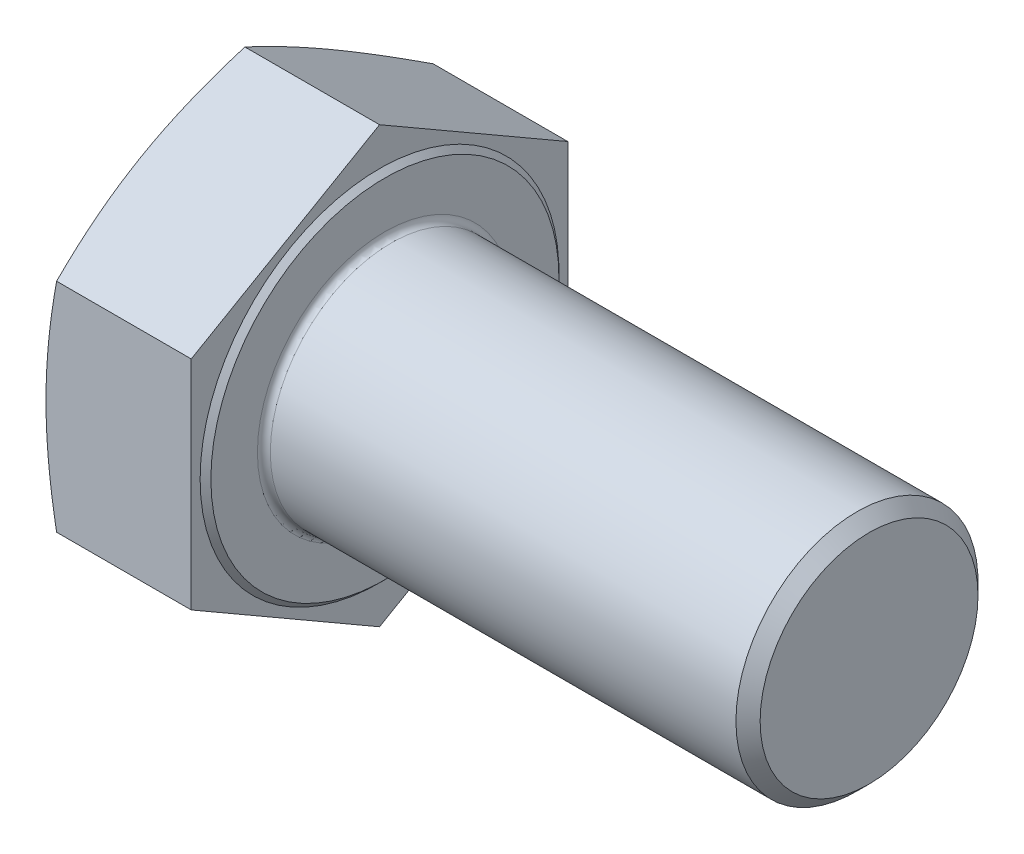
ISO-10303-21;
HEADER;
FILE_DESCRIPTION(('STEP AP214'),'2;1');
FILE_NAME('part.step','',(''),(''),'','','');
FILE_SCHEMA(('AUTOMOTIVE_DESIGN { 1 0 10303 214 1 1 1 1 }'));
ENDSEC;
DATA;
#1=APPLICATION_CONTEXT('core data for automotive mechanical design processes');
#2=APPLICATION_PROTOCOL_DEFINITION('international standard','automotive_design',2000,#1);
#3=PRODUCT_CONTEXT('',#1,'mechanical');
#4=PRODUCT('Part','Part','',(#3));
#5=PRODUCT_RELATED_PRODUCT_CATEGORY('part','',(#4));
#6=PRODUCT_DEFINITION_FORMATION('','',#4);
#7=PRODUCT_DEFINITION_CONTEXT('part definition',#1,'design');
#8=PRODUCT_DEFINITION('design','',#6,#7);
#9=PRODUCT_DEFINITION_SHAPE('','',#8);
#10=(LENGTH_UNIT() NAMED_UNIT(*) SI_UNIT(.MILLI.,.METRE.));
#11=(NAMED_UNIT(*) PLANE_ANGLE_UNIT() SI_UNIT($,.RADIAN.));
#12=(NAMED_UNIT(*) SI_UNIT($,.STERADIAN.) SOLID_ANGLE_UNIT());
#13=UNCERTAINTY_MEASURE_WITH_UNIT(LENGTH_MEASURE(1.E-05),#10,'distance_accuracy_value','');
#14=(GEOMETRIC_REPRESENTATION_CONTEXT(3) GLOBAL_UNCERTAINTY_ASSIGNED_CONTEXT((#13)) GLOBAL_UNIT_ASSIGNED_CONTEXT((#10,
#11,#12)) REPRESENTATION_CONTEXT('',''));
#15=CARTESIAN_POINT('',(0.,0.,0.));
#16=DIRECTION('',(0.,0.,1.));
#17=DIRECTION('',(1.,0.,0.));
#18=AXIS2_PLACEMENT_3D('',#15,#16,#17);
#19=CARTESIAN_POINT('',(28.,-20.2072594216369,35.));
#20=DIRECTION('',(-1.,0.,0.));
#21=DIRECTION('',(0.,0.,1.));
#22=AXIS2_PLACEMENT_3D('',#19,#20,#21);
#23=PLANE('',#22);
#24=CARTESIAN_POINT('',(28.,0.,0.));
#25=DIRECTION('',(-1.,0.,0.));
#26=DIRECTION('',(0.,0.,1.));
#27=AXIS2_PLACEMENT_3D('',#24,#25,#26);
#28=CIRCLE('',#27,23.7);
#29=CARTESIAN_POINT('',(28.,0.,23.7));
#30=VERTEX_POINT('',#29);
#31=EDGE_CURVE('E11',#30,#30,#28,.T.);
#32=ORIENTED_EDGE('',*,*,#31,.T.);
#33=EDGE_LOOP('',(#32));
#34=FACE_BOUND('',#33,.T.);
#35=CARTESIAN_POINT('',(28.,0.,0.));
#36=DIRECTION('',(-1.,0.,0.));
#37=DIRECTION('',(0.,0.,1.));
#38=AXIS2_PLACEMENT_3D('',#35,#36,#37);
#39=CIRCLE('',#38,32.35);
#40=CARTESIAN_POINT('',(28.,0.,32.35));
#41=VERTEX_POINT('',#40);
#42=EDGE_CURVE('E265',#41,#41,#39,.T.);
#43=ORIENTED_EDGE('',*,*,#42,.F.);
#44=EDGE_LOOP('',(#43));
#45=FACE_BOUND('',#44,.T.);
#46=ADVANCED_FACE('F32',(#34,#45),#23,.F.);
#47=CARTESIAN_POINT('',(28.,-20.2072594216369,35.));
#48=DIRECTION('',(0.,0.866025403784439,-0.5));
#49=DIRECTION('',(0.,0.5,0.866025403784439));
#50=AXIS2_PLACEMENT_3D('',#47,#48,#49);
#51=PLANE('',#50);
#52=CARTESIAN_POINT('',(1.97076571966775,-40.4146343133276,-0.000199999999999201));
#53=CARTESIAN_POINT('',(1.81846151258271,-39.9961731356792,0.724596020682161));
#54=CARTESIAN_POINT('',(1.67301140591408,-39.5770735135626,1.45049785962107));
#55=CARTESIAN_POINT('',(1.39731678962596,-38.7375871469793,2.90453089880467));
#56=CARTESIAN_POINT('',(1.2670737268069,-38.3172002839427,3.63266230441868));
#57=CARTESIAN_POINT('',(1.02322709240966,-37.4748874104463,5.09159099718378));
#58=CARTESIAN_POINT('',(0.909636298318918,-37.0529604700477,5.82238989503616));
#59=CARTESIAN_POINT('',(0.700720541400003,-36.2079846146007,7.28593100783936));
#60=CARTESIAN_POINT('',(0.605395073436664,-35.7849357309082,8.0186731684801));
#61=CARTESIAN_POINT('',(0.435219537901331,-34.9418343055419,9.47896767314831));
#62=CARTESIAN_POINT('',(0.36018488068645,-34.5217911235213,10.2065038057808));
#63=CARTESIAN_POINT('',(0.23060833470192,-33.6809087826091,11.6629547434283));
#64=CARTESIAN_POINT('',(0.176066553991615,-33.2600696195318,12.3918695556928));
#65=CARTESIAN_POINT('',(0.0884244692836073,-32.4179845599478,13.8504036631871));
#66=CARTESIAN_POINT('',(0.0553163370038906,-31.9967388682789,14.5800226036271));
#67=CARTESIAN_POINT('',(0.0111041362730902,-31.1539584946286,16.0397610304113));
#68=CARTESIAN_POINT('',(0.,-30.732423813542,16.7698805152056));
#69=CARTESIAN_POINT('',(0.,-29.8893544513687,18.2301194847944));
#70=CARTESIAN_POINT('',(0.0111041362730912,-29.4678197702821,18.9602389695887));
#71=CARTESIAN_POINT('',(0.0553163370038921,-28.6250393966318,20.4199773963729));
#72=CARTESIAN_POINT('',(0.0884244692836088,-28.2037937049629,21.1495963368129));
#73=CARTESIAN_POINT('',(0.176066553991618,-27.3617086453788,22.6081304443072));
#74=CARTESIAN_POINT('',(0.230608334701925,-26.9408694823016,23.3370452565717));
#75=CARTESIAN_POINT('',(0.360184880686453,-26.0999871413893,24.7934961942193));
#76=CARTESIAN_POINT('',(0.435219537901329,-25.6799439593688,25.5210323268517));
#77=CARTESIAN_POINT('',(0.605395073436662,-24.8368425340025,26.9813268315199));
#78=CARTESIAN_POINT('',(0.700720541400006,-24.41379365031,27.7140689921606));
#79=CARTESIAN_POINT('',(0.909636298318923,-23.568817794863,29.1776101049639));
#80=CARTESIAN_POINT('',(1.02322709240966,-23.1468908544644,29.9084090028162));
#81=CARTESIAN_POINT('',(1.2670737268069,-22.304577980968,31.3673376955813));
#82=CARTESIAN_POINT('',(1.39731678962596,-21.8841911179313,32.0954691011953));
#83=CARTESIAN_POINT('',(1.67301140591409,-21.0447047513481,33.5495021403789));
#84=CARTESIAN_POINT('',(1.81846151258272,-20.6256051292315,34.2754039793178));
#85=CARTESIAN_POINT('',(1.97076571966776,-20.207143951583,35.0002));
#86=B_SPLINE_CURVE_WITH_KNOTS('',3,(#52,#53,#54,#55,#56,#57,#58,#59,#60,#61,#62,#63,#64,#65,#66,
#67,#68,#69,#70,#71,#72,#73,#74,#75,#76,#77,#78,#79,#80,#81,#82,#83,#84,#85),.UNSPECIFIED.,.F.,
.F.,(4,2,2,2,2,2,2,2,2,2,2,2,2,2,2,2,4),(0.,2.55201795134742,5.10427850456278,7.65848730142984,
10.2126254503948,12.7426803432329,15.2727485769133,17.8018922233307,20.3310280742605,
22.8601639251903,25.3893075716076,27.9193758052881,30.4494306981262,33.0035688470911,
35.5577776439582,38.1100381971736,40.662056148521),.UNSPECIFIED.);
#87=CARTESIAN_POINT('',(1.9707236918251,-40.4145188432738,0.));
#88=VERTEX_POINT('',#87);
#89=CARTESIAN_POINT('',(0.,-30.3108891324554,17.5));
#90=VERTEX_POINT('',#89);
#91=EDGE_CURVE('E279',#88,#90,#86,.T.);
#92=ORIENTED_EDGE('',*,*,#91,.F.);
#93=DIRECTION('',(-1.,0.,0.));
#94=VECTOR('',#93,1.);
#95=CARTESIAN_POINT('',(28.,-40.4145188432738,0.));
#96=LINE('',#95,#94);
#97=CARTESIAN_POINT('',(27.,-40.4145188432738,0.));
#98=VERTEX_POINT('',#97);
#99=EDGE_CURVE('E144',#98,#88,#96,.T.);
#100=ORIENTED_EDGE('',*,*,#99,.F.);
#101=DIRECTION('',(0.,-0.5,-0.866025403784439));
#102=VECTOR('',#101,1.);
#103=CARTESIAN_POINT('',(27.,-20.2072594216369,35.));
#104=LINE('',#103,#102);
#105=CARTESIAN_POINT('',(27.,-20.2072594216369,35.));
#106=VERTEX_POINT('',#105);
#107=EDGE_CURVE('E135',#106,#98,#104,.T.);
#108=ORIENTED_EDGE('',*,*,#107,.F.);
#109=DIRECTION('',(-1.,0.,0.));
#110=VECTOR('',#109,1.);
#111=CARTESIAN_POINT('',(28.,-20.2072594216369,35.));
#112=LINE('',#111,#110);
#113=CARTESIAN_POINT('',(1.9707236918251,-20.2072594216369,35.));
#114=VERTEX_POINT('',#113);
#115=EDGE_CURVE('E130',#106,#114,#112,.T.);
#116=ORIENTED_EDGE('',*,*,#115,.T.);
#117=EDGE_CURVE('E124',#90,#114,#86,.T.);
#118=ORIENTED_EDGE('',*,*,#117,.F.);
#119=EDGE_LOOP('',(#92,#100,#108,#116,#118));
#120=FACE_BOUND('',#119,.T.);
#121=ADVANCED_FACE('F34',(#120),#51,.F.);
#122=CARTESIAN_POINT('',(28.,-40.4145188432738,0.));
#123=DIRECTION('',(0.,0.866025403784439,0.5));
#124=DIRECTION('',(0.,-0.5,0.866025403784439));
#125=AXIS2_PLACEMENT_3D('',#122,#123,#124);
#126=PLANE('',#125);
#127=CARTESIAN_POINT('',(1.97076571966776,-20.2071439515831,-35.0002));
#128=CARTESIAN_POINT('',(1.81846151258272,-20.6256051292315,-34.2754039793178));
#129=CARTESIAN_POINT('',(1.67301140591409,-21.0447047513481,-33.5495021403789));
#130=CARTESIAN_POINT('',(1.39731678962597,-21.8841911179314,-32.0954691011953));
#131=CARTESIAN_POINT('',(1.26707372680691,-22.304577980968,-31.3673376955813));
#132=CARTESIAN_POINT('',(1.02322709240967,-23.1468908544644,-29.9084090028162));
#133=CARTESIAN_POINT('',(0.909636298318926,-23.568817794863,-29.1776101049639));
#134=CARTESIAN_POINT('',(0.700720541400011,-24.41379365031,-27.7140689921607));
#135=CARTESIAN_POINT('',(0.605395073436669,-24.8368425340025,-26.9813268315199));
#136=CARTESIAN_POINT('',(0.435219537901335,-25.6799439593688,-25.5210323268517));
#137=CARTESIAN_POINT('',(0.360184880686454,-26.0999871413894,-24.7934961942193));
#138=CARTESIAN_POINT('',(0.230608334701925,-26.9408694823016,-23.3370452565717));
#139=CARTESIAN_POINT('',(0.176066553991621,-27.3617086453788,-22.6081304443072));
#140=CARTESIAN_POINT('',(0.0884244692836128,-28.2037937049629,-21.1495963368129));
#141=CARTESIAN_POINT('',(0.0553163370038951,-28.6250393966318,-20.4199773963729));
#142=CARTESIAN_POINT('',(0.0111041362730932,-29.4678197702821,-18.9602389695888));
#143=CARTESIAN_POINT('',(0.,-29.8893544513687,-18.2301194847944));
#144=CARTESIAN_POINT('',(0.,-30.732423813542,-16.7698805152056));
#145=CARTESIAN_POINT('',(0.0111041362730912,-31.1539584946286,-16.0397610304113));
#146=CARTESIAN_POINT('',(0.0553163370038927,-31.9967388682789,-14.5800226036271));
#147=CARTESIAN_POINT('',(0.0884244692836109,-32.4179845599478,-13.8504036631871));
#148=CARTESIAN_POINT('',(0.176066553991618,-33.2600696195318,-12.3918695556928));
#149=CARTESIAN_POINT('',(0.230608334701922,-33.6809087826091,-11.6629547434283));
#150=CARTESIAN_POINT('',(0.36018488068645,-34.5217911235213,-10.2065038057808));
#151=CARTESIAN_POINT('',(0.435219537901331,-34.9418343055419,-9.47896767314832));
#152=CARTESIAN_POINT('',(0.605395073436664,-35.7849357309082,-8.01867316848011));
#153=CARTESIAN_POINT('',(0.700720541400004,-36.2079846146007,-7.28593100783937));
#154=CARTESIAN_POINT('',(0.909636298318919,-37.0529604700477,-5.82238989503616));
#155=CARTESIAN_POINT('',(1.02322709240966,-37.4748874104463,-5.09159099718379));
#156=CARTESIAN_POINT('',(1.2670737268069,-38.3172002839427,-3.63266230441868));
#157=CARTESIAN_POINT('',(1.39731678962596,-38.7375871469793,-2.90453089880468));
#158=CARTESIAN_POINT('',(1.67301140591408,-39.5770735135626,-1.45049785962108));
#159=CARTESIAN_POINT('',(1.81846151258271,-39.9961731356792,-0.724596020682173));
#160=CARTESIAN_POINT('',(1.97076571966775,-40.4146343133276,0.000199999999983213));
#161=B_SPLINE_CURVE_WITH_KNOTS('',3,(#127,#128,#129,#130,#131,#132,#133,#134,#135,#136,#137,
#138,#139,#140,#141,#142,#143,#144,#145,#146,#147,#148,#149,#150,#151,#152,#153,#154,#155,#156,
#157,#158,#159,#160),.UNSPECIFIED.,.F.,.F.,(4,2,2,2,2,2,2,2,2,2,2,2,2,2,2,2,4),(0.,
2.55201795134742,5.10427850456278,7.65848730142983,10.2126254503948,12.7426803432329,
15.2727485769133,17.8018922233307,20.3310280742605,22.8601639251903,25.3893075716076,
27.9193758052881,30.4494306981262,33.0035688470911,35.5577776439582,38.1100381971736,
40.662056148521),.UNSPECIFIED.);
#162=CARTESIAN_POINT('',(1.9707236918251,-20.2072594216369,-35.));
#163=VERTEX_POINT('',#162);
#164=CARTESIAN_POINT('',(0.,-30.3108891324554,-17.5));
#165=VERTEX_POINT('',#164);
#166=EDGE_CURVE('E231',#163,#165,#161,.T.);
#167=ORIENTED_EDGE('',*,*,#166,.F.);
#168=DIRECTION('',(-1.,0.,0.));
#169=VECTOR('',#168,1.);
#170=CARTESIAN_POINT('',(28.,-20.2072594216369,-35.));
#171=LINE('',#170,#169);
#172=CARTESIAN_POINT('',(27.,-20.2072594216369,-35.));
#173=VERTEX_POINT('',#172);
#174=EDGE_CURVE('E141',#173,#163,#171,.T.);
#175=ORIENTED_EDGE('',*,*,#174,.F.);
#176=DIRECTION('',(0.,0.5,-0.866025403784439));
#177=VECTOR('',#176,1.);
#178=CARTESIAN_POINT('',(27.,-40.4145188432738,0.));
#179=LINE('',#178,#177);
#180=EDGE_CURVE('E269',#98,#173,#179,.T.);
#181=ORIENTED_EDGE('',*,*,#180,.F.);
#182=ORIENTED_EDGE('',*,*,#99,.T.);
#183=EDGE_CURVE('E227',#165,#88,#161,.T.);
#184=ORIENTED_EDGE('',*,*,#183,.F.);
#185=EDGE_LOOP('',(#167,#175,#181,#182,#184));
#186=FACE_BOUND('',#185,.T.);
#187=ADVANCED_FACE('F180',(#186),#126,.F.);
#188=CARTESIAN_POINT('',(28.,-20.2072594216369,-35.));
#189=DIRECTION('',(0.,0.,1.));
#190=DIRECTION('',(0.,-1.,0.));
#191=AXIS2_PLACEMENT_3D('',#188,#189,#190);
#192=PLANE('',#191);
#193=CARTESIAN_POINT('',(10.5307658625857,-53.5017175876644,-35.));
#194=CARTESIAN_POINT('',(10.2896176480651,-52.7099662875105,-35.));
#195=CARTESIAN_POINT('',(10.0499242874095,-51.9177704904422,-35.));
#196=CARTESIAN_POINT('',(9.57378078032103,-50.3324000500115,-35.));
#197=CARTESIAN_POINT('',(9.33733065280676,-49.5392254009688,-35.));
#198=CARTESIAN_POINT('',(8.8679916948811,-47.9517549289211,-35.));
#199=CARTESIAN_POINT('',(8.63510314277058,-47.157459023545,-35.));
#200=CARTESIAN_POINT('',(8.17330136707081,-45.5677145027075,-35.));
#201=CARTESIAN_POINT('',(7.94438813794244,-44.772265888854,-35.));
#202=CARTESIAN_POINT('',(7.26340339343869,-42.381063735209,-35.));
#203=CARTESIAN_POINT('',(6.81796451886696,-40.7834111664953,-35.));
#204=CARTESIAN_POINT('',(5.94899895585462,-37.5821688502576,-35.));
#205=CARTESIAN_POINT('',(5.52547187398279,-35.9785792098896,-35.));
#206=CARTESIAN_POINT('',(4.71082797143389,-32.7842021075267,-35.));
#207=CARTESIAN_POINT('',(4.3193759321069,-31.1935005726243,-35.));
#208=CARTESIAN_POINT('',(3.5697983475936,-28.0041834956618,-35.));
#209=CARTESIAN_POINT('',(3.21167336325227,-26.4055678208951,-35.));
#210=CARTESIAN_POINT('',(2.53710111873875,-23.2000589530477,-35.));
#211=CARTESIAN_POINT('',(2.22063964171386,-21.5931687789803,-35.));
#212=CARTESIAN_POINT('',(1.63902722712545,-18.3700749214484,-35.));
#213=CARTESIAN_POINT('',(1.37387457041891,-16.753871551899,-35.));
#214=CARTESIAN_POINT('',(0.931916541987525,-13.6940717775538,-35.));
#215=CARTESIAN_POINT('',(0.748538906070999,-12.2514396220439,-35.));
#216=CARTESIAN_POINT('',(0.515701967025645,-10.0829941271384,-35.));
#217=CARTESIAN_POINT('',(0.445127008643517,-9.35941624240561,-35.));
#218=CARTESIAN_POINT('',(0.318847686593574,-7.91097072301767,-35.));
#219=CARTESIAN_POINT('',(0.263142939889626,-7.18610312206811,-35.));
#220=CARTESIAN_POINT('',(0.167323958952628,-5.73583584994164,-35.));
#221=CARTESIAN_POINT('',(0.127199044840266,-5.01043688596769,-35.));
#222=CARTESIAN_POINT('',(0.0630037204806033,-3.55892598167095,-35.));
#223=CARTESIAN_POINT('',(0.0389332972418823,-2.83281404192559,-35.));
#224=CARTESIAN_POINT('',(0.0071706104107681,-1.3802332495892,-35.));
#225=CARTESIAN_POINT('',(-0.000521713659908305,-0.653764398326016,-35.));
#226=CARTESIAN_POINT('',(0.000576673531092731,0.799160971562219,-35.));
#227=CARTESIAN_POINT('',(0.00936739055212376,1.52561749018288,-35.));
#228=CARTESIAN_POINT('',(0.0433979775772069,2.98182772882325,-35.));
#229=CARTESIAN_POINT('',(0.0687209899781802,3.71157949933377,-35.));
#230=CARTESIAN_POINT('',(0.135553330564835,5.17033813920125,-35.));
#231=CARTESIAN_POINT('',(0.177062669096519,5.89934500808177,-35.));
#232=CARTESIAN_POINT('',(0.275727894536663,7.35629809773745,-35.));
#233=CARTESIAN_POINT('',(0.332883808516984,8.08424431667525,-35.));
#234=CARTESIAN_POINT('',(0.462134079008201,9.53881603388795,-35.));
#235=CARTESIAN_POINT('',(0.534228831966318,10.2654414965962,-35.));
#236=CARTESIAN_POINT('',(0.771829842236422,12.4441953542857,-35.));
#237=CARTESIAN_POINT('',(0.958571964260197,13.8940427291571,-35.));
#238=CARTESIAN_POINT('',(1.38115378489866,16.7864350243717,-35.));
#239=CARTESIAN_POINT('',(1.61699374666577,18.228979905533,-35.));
#240=CARTESIAN_POINT('',(2.14365741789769,21.1827386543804,-35.));
#241=CARTESIAN_POINT('',(2.43672963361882,22.6935487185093,-35.));
#242=CARTESIAN_POINT('',(3.06059481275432,25.7074066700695,-35.));
#243=CARTESIAN_POINT('',(3.39139061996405,27.2104539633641,-35.));
#244=CARTESIAN_POINT('',(4.08375623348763,30.209862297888,-35.));
#245=CARTESIAN_POINT('',(4.44533497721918,31.7062212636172,-35.));
#246=CARTESIAN_POINT('',(5.19338483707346,34.6926354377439,-35.));
#247=CARTESIAN_POINT('',(5.57985535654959,36.1826907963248,-35.));
#248=CARTESIAN_POINT('',(6.37354520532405,39.1592953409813,-35.));
#249=CARTESIAN_POINT('',(6.78079054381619,40.6458375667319,-35.));
#250=CARTESIAN_POINT('',(7.61184753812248,43.6142777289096,-35.));
#251=CARTESIAN_POINT('',(8.03565926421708,45.0961756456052,-35.));
#252=CARTESIAN_POINT('',(8.89681684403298,48.0557555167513,-35.));
#253=CARTESIAN_POINT('',(9.33416041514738,49.5334381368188,-35.));
#254=CARTESIAN_POINT('',(10.2200982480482,52.4854177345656,-35.));
#255=CARTESIAN_POINT('',(10.6686924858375,53.959714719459,-35.));
#256=CARTESIAN_POINT('',(11.5702531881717,56.8891579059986,-35.));
#257=CARTESIAN_POINT('',(12.023116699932,58.34433583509,-35.));
#258=CARTESIAN_POINT('',(12.9365578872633,61.2522662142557,-35.));
#259=CARTESIAN_POINT('',(13.3971355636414,62.7050186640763,-35.));
#260=CARTESIAN_POINT('',(14.324846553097,65.6085005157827,-35.));
#261=CARTESIAN_POINT('',(14.7919801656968,67.059229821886,-35.));
#262=CARTESIAN_POINT('',(15.7318214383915,69.9588820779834,-35.));
#263=CARTESIAN_POINT('',(16.2045291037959,71.4078050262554,-35.));
#264=CARTESIAN_POINT('',(17.1529253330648,74.2985834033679,-35.));
#265=CARTESIAN_POINT('',(17.6285957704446,75.7404447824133,-35.));
#266=CARTESIAN_POINT('',(18.5840413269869,78.6228072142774,-35.));
#267=CARTESIAN_POINT('',(19.0638164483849,80.0633082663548,-35.));
#268=CARTESIAN_POINT('',(20.0268909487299,82.9430001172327,-35.));
#269=CARTESIAN_POINT('',(20.5101900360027,84.3821910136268,-35.));
#270=CARTESIAN_POINT('',(21.479915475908,87.2595151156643,-35.));
#271=CARTESIAN_POINT('',(21.9663418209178,88.6976483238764,-35.));
#272=CARTESIAN_POINT('',(22.4541150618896,90.1353234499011,-35.));
#273=B_SPLINE_CURVE_WITH_KNOTS('',3,(#193,#194,#195,#196,#197,#198,#199,#200,#201,#202,#203,
#204,#205,#206,#207,#208,#209,#210,#211,#212,#213,#214,#215,#216,#217,#218,#219,#220,#221,#222,
#223,#224,#225,#226,#227,#228,#229,#230,#231,#232,#233,#234,#235,#236,#237,#238,#239,#240,#241,
#242,#243,#244,#245,#246,#247,#248,#249,#250,#251,#252,#253,#254,#255,#256,#257,#258,#259,#260,
#261,#262,#263,#264,#265,#266,#267,#268,#269,#270,#271,#272),.UNSPECIFIED.,.F.,.F.,(4,2,2,2,2,2,
2,2,2,2,2,2,2,2,2,2,2,2,2,2,2,2,2,2,2,2,2,2,2,2,2,2,2,2,2,2,2,2,2,4),(0.,2.48298319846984,
4.96598087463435,7.44917159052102,9.93235884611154,14.9079872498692,19.8835262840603,
24.7977195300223,29.7119954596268,34.6245901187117,39.5370201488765,43.898673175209,
46.0795788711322,48.2604283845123,50.4397802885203,52.6191304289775,54.7984725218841,
56.9778153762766,59.168203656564,61.3585933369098,63.5489868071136,65.7394384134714,
70.123823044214,74.508231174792,79.1245515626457,83.7412201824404,88.3592337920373,
92.9771367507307,97.600970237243,102.224823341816,106.847900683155,111.470968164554,
116.042994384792,120.615021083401,125.187257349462,129.759497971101,134.31438274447,
138.869269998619,143.423784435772,147.978287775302),.UNSPECIFIED.);
#274=CARTESIAN_POINT('',(1.9707236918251,20.2072594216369,-35.));
#275=VERTEX_POINT('',#274);
#276=CARTESIAN_POINT('',(0.,0.,-35.));
#277=VERTEX_POINT('',#276);
#278=EDGE_CURVE('E304',#275,#277,#273,.F.);
#279=ORIENTED_EDGE('',*,*,#278,.F.);
#280=DIRECTION('',(-1.,0.,0.));
#281=VECTOR('',#280,1.);
#282=CARTESIAN_POINT('',(28.,20.2072594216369,-35.));
#283=LINE('',#282,#281);
#284=CARTESIAN_POINT('',(27.,20.2072594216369,-35.));
#285=VERTEX_POINT('',#284);
#286=EDGE_CURVE('E132',#285,#275,#283,.T.);
#287=ORIENTED_EDGE('',*,*,#286,.F.);
#288=DIRECTION('',(0.,1.,0.));
#289=VECTOR('',#288,1.);
#290=CARTESIAN_POINT('',(27.,-20.2072594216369,-35.));
#291=LINE('',#290,#289);
#292=EDGE_CURVE('E262',#173,#285,#291,.T.);
#293=ORIENTED_EDGE('',*,*,#292,.F.);
#294=ORIENTED_EDGE('',*,*,#174,.T.);
#295=EDGE_CURVE('E232',#277,#163,#273,.F.);
#296=ORIENTED_EDGE('',*,*,#295,.F.);
#297=EDGE_LOOP('',(#279,#287,#293,#294,#296));
#298=FACE_BOUND('',#297,.T.);
#299=ADVANCED_FACE('F240',(#298),#192,.F.);
#300=CARTESIAN_POINT('',(28.,20.2072594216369,-35.));
#301=DIRECTION('',(0.,-0.866025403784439,0.5));
#302=DIRECTION('',(0.,-0.5,-0.866025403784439));
#303=AXIS2_PLACEMENT_3D('',#300,#301,#302);
#304=PLANE('',#303);
#305=CARTESIAN_POINT('',(1.97076571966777,40.4146343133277,0.000199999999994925));
#306=CARTESIAN_POINT('',(1.81846151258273,39.9961731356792,-0.724596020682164));
#307=CARTESIAN_POINT('',(1.6730114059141,39.5770735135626,-1.45049785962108));
#308=CARTESIAN_POINT('',(1.39731678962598,38.7375871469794,-2.90453089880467));
#309=CARTESIAN_POINT('',(1.26707372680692,38.3172002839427,-3.63266230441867));
#310=CARTESIAN_POINT('',(1.02322709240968,37.4748874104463,-5.09159099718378));
#311=CARTESIAN_POINT('',(0.909636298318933,37.0529604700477,-5.82238989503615));
#312=CARTESIAN_POINT('',(0.700720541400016,36.2079846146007,-7.28593100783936));
#313=CARTESIAN_POINT('',(0.605395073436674,35.7849357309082,-8.0186731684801));
#314=CARTESIAN_POINT('',(0.435219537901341,34.9418343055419,-9.47896767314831));
#315=CARTESIAN_POINT('',(0.360184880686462,34.5217911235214,-10.2065038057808));
#316=CARTESIAN_POINT('',(0.230608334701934,33.6809087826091,-11.6629547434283));
#317=CARTESIAN_POINT('',(0.176066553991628,33.2600696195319,-12.3918695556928));
#318=CARTESIAN_POINT('',(0.0884244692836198,32.4179845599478,-13.8504036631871));
#319=CARTESIAN_POINT('',(0.0553163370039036,31.9967388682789,-14.5800226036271));
#320=CARTESIAN_POINT('',(0.0111041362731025,31.1539584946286,-16.0397610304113));
#321=CARTESIAN_POINT('',(0.,30.732423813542,-16.7698805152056));
#322=CARTESIAN_POINT('',(0.,29.8893544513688,-18.2301194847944));
#323=CARTESIAN_POINT('',(0.0111041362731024,29.4678197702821,-18.9602389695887));
#324=CARTESIAN_POINT('',(0.055316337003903,28.6250393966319,-20.4199773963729));
#325=CARTESIAN_POINT('',(0.0884244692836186,28.203793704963,-21.1495963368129));
#326=CARTESIAN_POINT('',(0.176066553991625,27.3617086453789,-22.6081304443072));
#327=CARTESIAN_POINT('',(0.23060833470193,26.9408694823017,-23.3370452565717));
#328=CARTESIAN_POINT('',(0.36018488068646,26.0999871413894,-24.7934961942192));
#329=CARTESIAN_POINT('',(0.43521953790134,25.6799439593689,-25.5210323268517));
#330=CARTESIAN_POINT('',(0.605395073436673,24.8368425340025,-26.9813268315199));
#331=CARTESIAN_POINT('',(0.700720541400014,24.41379365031,-27.7140689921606));
#332=CARTESIAN_POINT('',(0.909636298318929,23.568817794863,-29.1776101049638));
#333=CARTESIAN_POINT('',(1.02322709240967,23.1468908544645,-29.9084090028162));
#334=CARTESIAN_POINT('',(1.26707372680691,22.3045779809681,-31.3673376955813));
#335=CARTESIAN_POINT('',(1.39731678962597,21.8841911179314,-32.0954691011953));
#336=CARTESIAN_POINT('',(1.67301140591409,21.0447047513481,-33.5495021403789));
#337=CARTESIAN_POINT('',(1.81846151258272,20.6256051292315,-34.2754039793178));
#338=CARTESIAN_POINT('',(1.97076571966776,20.2071439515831,-35.0002));
#339=B_SPLINE_CURVE_WITH_KNOTS('',3,(#305,#306,#307,#308,#309,#310,#311,#312,#313,#314,#315,
#316,#317,#318,#319,#320,#321,#322,#323,#324,#325,#326,#327,#328,#329,#330,#331,#332,#333,#334,
#335,#336,#337,#338),.UNSPECIFIED.,.F.,.F.,(4,2,2,2,2,2,2,2,2,2,2,2,2,2,2,2,4),(0.,
2.55201795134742,5.10427850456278,7.65848730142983,10.2126254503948,12.7426803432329,
15.2727485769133,17.8018922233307,20.3310280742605,22.8601639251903,25.3893075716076,
27.9193758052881,30.4494306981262,33.0035688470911,35.5577776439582,38.1100381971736,
40.662056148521),.UNSPECIFIED.);
#340=CARTESIAN_POINT('',(1.9707236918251,40.4145188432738,0.));
#341=VERTEX_POINT('',#340);
#342=CARTESIAN_POINT('',(0.,30.3108891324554,-17.5));
#343=VERTEX_POINT('',#342);
#344=EDGE_CURVE('E222',#341,#343,#339,.T.);
#345=ORIENTED_EDGE('',*,*,#344,.F.);
#346=DIRECTION('',(-1.,0.,0.));
#347=VECTOR('',#346,1.);
#348=CARTESIAN_POINT('',(28.,40.4145188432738,0.));
#349=LINE('',#348,#347);
#350=CARTESIAN_POINT('',(27.,40.4145188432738,0.));
#351=VERTEX_POINT('',#350);
#352=EDGE_CURVE('E129',#351,#341,#349,.T.);
#353=ORIENTED_EDGE('',*,*,#352,.F.);
#354=DIRECTION('',(0.,0.5,0.866025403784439));
#355=VECTOR('',#354,1.);
#356=CARTESIAN_POINT('',(27.,20.2072594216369,-35.));
#357=LINE('',#356,#355);
#358=EDGE_CURVE('E259',#285,#351,#357,.T.);
#359=ORIENTED_EDGE('',*,*,#358,.F.);
#360=ORIENTED_EDGE('',*,*,#286,.T.);
#361=EDGE_CURVE('E256',#343,#275,#339,.T.);
#362=ORIENTED_EDGE('',*,*,#361,.F.);
#363=EDGE_LOOP('',(#345,#353,#359,#360,#362));
#364=FACE_BOUND('',#363,.T.);
#365=ADVANCED_FACE('F244',(#364),#304,.F.);
#366=CARTESIAN_POINT('',(28.,40.4145188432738,0.));
#367=DIRECTION('',(0.,-0.866025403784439,-0.5));
#368=DIRECTION('',(0.,0.5,-0.866025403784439));
#369=AXIS2_PLACEMENT_3D('',#366,#367,#368);
#370=PLANE('',#369);
#371=CARTESIAN_POINT('',(1.97076571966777,20.2071439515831,35.0002));
#372=CARTESIAN_POINT('',(1.81846151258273,20.6256051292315,34.2754039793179));
#373=CARTESIAN_POINT('',(1.6730114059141,21.0447047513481,33.5495021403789));
#374=CARTESIAN_POINT('',(1.39731678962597,21.8841911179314,32.0954691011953));
#375=CARTESIAN_POINT('',(1.26707372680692,22.3045779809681,31.3673376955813));
#376=CARTESIAN_POINT('',(1.02322709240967,23.1468908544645,29.9084090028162));
#377=CARTESIAN_POINT('',(0.909636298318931,23.568817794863,29.1776101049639));
#378=CARTESIAN_POINT('',(0.700720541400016,24.41379365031,27.7140689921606));
#379=CARTESIAN_POINT('',(0.605395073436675,24.8368425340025,26.9813268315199));
#380=CARTESIAN_POINT('',(0.435219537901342,25.6799439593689,25.5210323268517));
#381=CARTESIAN_POINT('',(0.360184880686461,26.0999871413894,24.7934961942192));
#382=CARTESIAN_POINT('',(0.230608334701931,26.9408694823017,23.3370452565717));
#383=CARTESIAN_POINT('',(0.176066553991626,27.3617086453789,22.6081304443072));
#384=CARTESIAN_POINT('',(0.0884244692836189,28.203793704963,21.1495963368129));
#385=CARTESIAN_POINT('',(0.0553163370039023,28.6250393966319,20.4199773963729));
#386=CARTESIAN_POINT('',(0.0111041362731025,29.4678197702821,18.9602389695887));
#387=CARTESIAN_POINT('',(0.,29.8893544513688,18.2301194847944));
#388=CARTESIAN_POINT('',(0.,30.732423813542,16.7698805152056));
#389=CARTESIAN_POINT('',(0.0111041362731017,31.1539584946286,16.0397610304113));
#390=CARTESIAN_POINT('',(0.0553163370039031,31.9967388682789,14.5800226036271));
#391=CARTESIAN_POINT('',(0.0884244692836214,32.4179845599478,13.8504036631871));
#392=CARTESIAN_POINT('',(0.176066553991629,33.2600696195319,12.3918695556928));
#393=CARTESIAN_POINT('',(0.230608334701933,33.6809087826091,11.6629547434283));
#394=CARTESIAN_POINT('',(0.360184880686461,34.5217911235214,10.2065038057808));
#395=CARTESIAN_POINT('',(0.435219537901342,34.9418343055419,9.4789676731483));
#396=CARTESIAN_POINT('',(0.605395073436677,35.7849357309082,8.01867316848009));
#397=CARTESIAN_POINT('',(0.700720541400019,36.2079846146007,7.28593100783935));
#398=CARTESIAN_POINT('',(0.909636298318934,37.0529604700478,5.82238989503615));
#399=CARTESIAN_POINT('',(1.02322709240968,37.4748874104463,5.09159099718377));
#400=CARTESIAN_POINT('',(1.26707372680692,38.3172002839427,3.63266230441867));
#401=CARTESIAN_POINT('',(1.39731678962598,38.7375871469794,2.90453089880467));
#402=CARTESIAN_POINT('',(1.6730114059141,39.5770735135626,1.45049785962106));
#403=CARTESIAN_POINT('',(1.81846151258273,39.9961731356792,0.724596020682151));
#404=CARTESIAN_POINT('',(1.97076571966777,40.4146343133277,-0.00020000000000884));
#405=B_SPLINE_CURVE_WITH_KNOTS('',3,(#371,#372,#373,#374,#375,#376,#377,#378,#379,#380,#381,
#382,#383,#384,#385,#386,#387,#388,#389,#390,#391,#392,#393,#394,#395,#396,#397,#398,#399,#400,
#401,#402,#403,#404),.UNSPECIFIED.,.F.,.F.,(4,2,2,2,2,2,2,2,2,2,2,2,2,2,2,2,4),(0.,
2.55201795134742,5.10427850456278,7.65848730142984,10.2126254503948,12.7426803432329,
15.2727485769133,17.8018922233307,20.3310280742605,22.8601639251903,25.3893075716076,
27.9193758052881,30.4494306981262,33.0035688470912,35.5577776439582,38.1100381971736,
40.662056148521),.UNSPECIFIED.);
#406=CARTESIAN_POINT('',(1.9707236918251,20.2072594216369,35.));
#407=VERTEX_POINT('',#406);
#408=CARTESIAN_POINT('',(0.,30.3108891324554,17.5));
#409=VERTEX_POINT('',#408);
#410=EDGE_CURVE('E109',#407,#409,#405,.T.);
#411=ORIENTED_EDGE('',*,*,#410,.F.);
#412=DIRECTION('',(-1.,0.,0.));
#413=VECTOR('',#412,1.);
#414=CARTESIAN_POINT('',(28.,20.2072594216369,35.));
#415=LINE('',#414,#413);
#416=CARTESIAN_POINT('',(27.,20.2072594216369,35.));
#417=VERTEX_POINT('',#416);
#418=EDGE_CURVE('E121',#417,#407,#415,.T.);
#419=ORIENTED_EDGE('',*,*,#418,.F.);
#420=DIRECTION('',(0.,-0.5,0.866025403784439));
#421=VECTOR('',#420,1.);
#422=CARTESIAN_POINT('',(27.,40.4145188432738,0.));
#423=LINE('',#422,#421);
#424=EDGE_CURVE('E56',#351,#417,#423,.T.);
#425=ORIENTED_EDGE('',*,*,#424,.F.);
#426=ORIENTED_EDGE('',*,*,#352,.T.);
#427=EDGE_CURVE('E123',#409,#341,#405,.T.);
#428=ORIENTED_EDGE('',*,*,#427,.F.);
#429=EDGE_LOOP('',(#411,#419,#425,#426,#428));
#430=FACE_BOUND('',#429,.T.);
#431=ADVANCED_FACE('F120',(#430),#370,.F.);
#432=CARTESIAN_POINT('',(28.,20.2072594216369,35.));
#433=DIRECTION('',(0.,0.,-1.));
#434=DIRECTION('',(-1.,0.,0.));
#435=AXIS2_PLACEMENT_3D('',#432,#433,#434);
#436=PLANE('',#435);
#437=CARTESIAN_POINT('',(10.5307658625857,-53.5017175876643,35.));
#438=CARTESIAN_POINT('',(10.2896176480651,-52.7099662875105,35.));
#439=CARTESIAN_POINT('',(10.0499242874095,-51.9177704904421,35.));
#440=CARTESIAN_POINT('',(9.57378078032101,-50.3324000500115,35.));
#441=CARTESIAN_POINT('',(9.33733065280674,-49.5392254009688,35.));
#442=CARTESIAN_POINT('',(8.86799169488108,-47.951754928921,35.));
#443=CARTESIAN_POINT('',(8.63510314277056,-47.1574590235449,35.));
#444=CARTESIAN_POINT('',(8.17330136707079,-45.5677145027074,35.));
#445=CARTESIAN_POINT('',(7.94438813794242,-44.7722658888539,35.));
#446=CARTESIAN_POINT('',(7.26340339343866,-42.3810637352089,35.));
#447=CARTESIAN_POINT('',(6.81796451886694,-40.7834111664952,35.));
#448=CARTESIAN_POINT('',(5.9489989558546,-37.5821688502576,35.));
#449=CARTESIAN_POINT('',(5.52547187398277,-35.9785792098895,35.));
#450=CARTESIAN_POINT('',(4.71082797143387,-32.7842021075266,35.));
#451=CARTESIAN_POINT('',(4.31937593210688,-31.1935005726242,35.));
#452=CARTESIAN_POINT('',(3.56979834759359,-28.0041834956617,35.));
#453=CARTESIAN_POINT('',(3.21167336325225,-26.405567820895,35.));
#454=CARTESIAN_POINT('',(2.53710111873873,-23.2000589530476,35.));
#455=CARTESIAN_POINT('',(2.22063964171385,-21.5931687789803,35.));
#456=CARTESIAN_POINT('',(1.63902722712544,-18.3700749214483,35.));
#457=CARTESIAN_POINT('',(1.37387457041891,-16.7538715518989,35.));
#458=CARTESIAN_POINT('',(0.93191654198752,-13.6940717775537,35.));
#459=CARTESIAN_POINT('',(0.748538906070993,-12.2514396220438,35.));
#460=CARTESIAN_POINT('',(0.515701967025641,-10.0829941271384,35.));
#461=CARTESIAN_POINT('',(0.445127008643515,-9.35941624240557,35.));
#462=CARTESIAN_POINT('',(0.318847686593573,-7.91097072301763,35.));
#463=CARTESIAN_POINT('',(0.263142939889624,-7.18610312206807,35.));
#464=CARTESIAN_POINT('',(0.167323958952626,-5.7358358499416,35.));
#465=CARTESIAN_POINT('',(0.127199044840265,-5.01043688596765,35.));
#466=CARTESIAN_POINT('',(0.0630037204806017,-3.55892598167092,35.));
#467=CARTESIAN_POINT('',(0.0389332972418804,-2.83281404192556,35.));
#468=CARTESIAN_POINT('',(0.00717061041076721,-1.38023324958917,35.));
#469=CARTESIAN_POINT('',(-0.000521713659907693,-0.653764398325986,35.));
#470=CARTESIAN_POINT('',(0.000576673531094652,0.799160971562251,35.));
#471=CARTESIAN_POINT('',(0.00936739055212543,1.52561749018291,35.));
#472=CARTESIAN_POINT('',(0.043397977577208,2.98182772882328,35.));
#473=CARTESIAN_POINT('',(0.068720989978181,3.7115794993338,35.));
#474=CARTESIAN_POINT('',(0.135553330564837,5.17033813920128,35.));
#475=CARTESIAN_POINT('',(0.177062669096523,5.89934500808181,35.));
#476=CARTESIAN_POINT('',(0.275727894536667,7.35629809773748,35.));
#477=CARTESIAN_POINT('',(0.332883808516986,8.08424431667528,35.));
#478=CARTESIAN_POINT('',(0.462134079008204,9.53881603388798,35.));
#479=CARTESIAN_POINT('',(0.534228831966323,10.2654414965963,35.));
#480=CARTESIAN_POINT('',(0.771829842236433,12.4441953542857,35.));
#481=CARTESIAN_POINT('',(0.958571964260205,13.8940427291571,35.));
#482=CARTESIAN_POINT('',(1.38115378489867,16.7864350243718,35.));
#483=CARTESIAN_POINT('',(1.61699374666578,18.228979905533,35.));
#484=CARTESIAN_POINT('',(2.1436574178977,21.1827386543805,35.));
#485=CARTESIAN_POINT('',(2.43672963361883,22.6935487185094,35.));
#486=CARTESIAN_POINT('',(3.06059481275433,25.7074066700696,35.));
#487=CARTESIAN_POINT('',(3.39139061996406,27.2104539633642,35.));
#488=CARTESIAN_POINT('',(4.08375623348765,30.209862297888,35.));
#489=CARTESIAN_POINT('',(4.4453349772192,31.7062212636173,35.));
#490=CARTESIAN_POINT('',(5.19338483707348,34.692635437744,35.));
#491=CARTESIAN_POINT('',(5.5798553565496,36.1826907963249,35.));
#492=CARTESIAN_POINT('',(6.37354520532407,39.1592953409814,35.));
#493=CARTESIAN_POINT('',(6.78079054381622,40.6458375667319,35.));
#494=CARTESIAN_POINT('',(7.61184753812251,43.6142777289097,35.));
#495=CARTESIAN_POINT('',(8.0356592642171,45.0961756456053,35.));
#496=CARTESIAN_POINT('',(8.896816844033,48.0557555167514,35.));
#497=CARTESIAN_POINT('',(9.33416041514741,49.5334381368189,35.));
#498=CARTESIAN_POINT('',(10.2200982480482,52.4854177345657,35.));
#499=CARTESIAN_POINT('',(10.6686924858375,53.9597147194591,35.));
#500=CARTESIAN_POINT('',(11.5702531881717,56.8891579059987,35.));
#501=CARTESIAN_POINT('',(12.023116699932,58.34433583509,35.));
#502=CARTESIAN_POINT('',(12.9365578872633,61.2522662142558,35.));
#503=CARTESIAN_POINT('',(13.3971355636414,62.7050186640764,35.));
#504=CARTESIAN_POINT('',(14.324846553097,65.6085005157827,35.));
#505=CARTESIAN_POINT('',(14.7919801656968,67.0592298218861,35.));
#506=CARTESIAN_POINT('',(15.7318214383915,69.9588820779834,35.));
#507=CARTESIAN_POINT('',(16.2045291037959,71.4078050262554,35.));
#508=CARTESIAN_POINT('',(17.1529253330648,74.2985834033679,35.));
#509=CARTESIAN_POINT('',(17.6285957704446,75.7404447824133,35.));
#510=CARTESIAN_POINT('',(18.5840413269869,78.6228072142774,35.));
#511=CARTESIAN_POINT('',(19.0638164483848,80.0633082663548,35.));
#512=CARTESIAN_POINT('',(20.0268909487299,82.9430001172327,35.));
#513=CARTESIAN_POINT('',(20.5101900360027,84.3821910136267,35.));
#514=CARTESIAN_POINT('',(21.479915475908,87.2595151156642,35.));
#515=CARTESIAN_POINT('',(21.9663418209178,88.6976483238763,35.));
#516=CARTESIAN_POINT('',(22.4541150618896,90.1353234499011,35.));
#517=B_SPLINE_CURVE_WITH_KNOTS('',3,(#437,#438,#439,#440,#441,#442,#443,#444,#445,#446,#447,
#448,#449,#450,#451,#452,#453,#454,#455,#456,#457,#458,#459,#460,#461,#462,#463,#464,#465,#466,
#467,#468,#469,#470,#471,#472,#473,#474,#475,#476,#477,#478,#479,#480,#481,#482,#483,#484,#485,
#486,#487,#488,#489,#490,#491,#492,#493,#494,#495,#496,#497,#498,#499,#500,#501,#502,#503,#504,
#505,#506,#507,#508,#509,#510,#511,#512,#513,#514,#515,#516),.UNSPECIFIED.,.F.,.F.,(4,2,2,2,2,2,
2,2,2,2,2,2,2,2,2,2,2,2,2,2,2,2,2,2,2,2,2,2,2,2,2,2,2,2,2,2,2,2,2,4),(0.,2.48298319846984,
4.96598087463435,7.44917159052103,9.93235884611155,14.9079872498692,19.8835262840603,
24.7977195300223,29.7119954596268,34.6245901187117,39.5370201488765,43.898673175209,
46.0795788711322,48.2604283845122,50.4397802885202,52.6191304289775,54.7984725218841,
56.9778153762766,59.168203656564,61.3585933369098,63.5489868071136,65.7394384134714,
70.123823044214,74.508231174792,79.1245515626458,83.7412201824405,88.3592337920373,
92.9771367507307,97.600970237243,102.224823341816,106.847900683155,111.470968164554,
116.042994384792,120.615021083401,125.187257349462,129.759497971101,134.314382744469,
138.869269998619,143.423784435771,147.978287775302),.UNSPECIFIED.);
#518=CARTESIAN_POINT('',(0.,0.,35.));
#519=VERTEX_POINT('',#518);
#520=EDGE_CURVE('E115',#114,#519,#517,.T.);
#521=ORIENTED_EDGE('',*,*,#520,.F.);
#522=ORIENTED_EDGE('',*,*,#115,.F.);
#523=DIRECTION('',(0.,-1.,0.));
#524=VECTOR('',#523,1.);
#525=CARTESIAN_POINT('',(27.,20.2072594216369,35.));
#526=LINE('',#525,#524);
#527=EDGE_CURVE('E128',#417,#106,#526,.T.);
#528=ORIENTED_EDGE('',*,*,#527,.F.);
#529=ORIENTED_EDGE('',*,*,#418,.T.);
#530=EDGE_CURVE('E106',#519,#407,#517,.T.);
#531=ORIENTED_EDGE('',*,*,#530,.F.);
#532=EDGE_LOOP('',(#521,#522,#528,#529,#531));
#533=FACE_BOUND('',#532,.T.);
#534=ADVANCED_FACE('F126',(#533),#436,.F.);
#535=CARTESIAN_POINT('',(27.,33.35,0.));
#536=DIRECTION('',(1.,0.,0.));
#537=DIRECTION('',(0.,0.,-1.));
#538=AXIS2_PLACEMENT_3D('',#535,#536,#537);
#539=PLANE('',#538);
#540=CARTESIAN_POINT('',(27.,0.,0.));
#541=DIRECTION('',(-1.,0.,0.));
#542=DIRECTION('',(0.,0.,1.));
#543=AXIS2_PLACEMENT_3D('',#540,#541,#542);
#544=CIRCLE('',#543,33.35);
#545=CARTESIAN_POINT('',(27.,0.,33.35));
#546=VERTEX_POINT('',#545);
#547=EDGE_CURVE('E260',#546,#546,#544,.T.);
#548=ORIENTED_EDGE('',*,*,#547,.T.);
#549=EDGE_LOOP('',(#548));
#550=FACE_BOUND('',#549,.T.);
#551=ORIENTED_EDGE('',*,*,#107,.T.);
#552=ORIENTED_EDGE('',*,*,#180,.T.);
#553=ORIENTED_EDGE('',*,*,#292,.T.);
#554=ORIENTED_EDGE('',*,*,#358,.T.);
#555=ORIENTED_EDGE('',*,*,#424,.T.);
#556=ORIENTED_EDGE('',*,*,#527,.T.);
#557=EDGE_LOOP('',(#551,#552,#553,#554,#555,#556));
#558=FACE_BOUND('',#557,.T.);
#559=ADVANCED_FACE('F190',(#550,#558),#539,.T.);
#560=CARTESIAN_POINT('',(27.,0.,0.));
#561=DIRECTION('',(-1.,0.,0.));
#562=DIRECTION('',(0.,0.,1.));
#563=AXIS2_PLACEMENT_3D('',#560,#561,#562);
#564=CONICAL_SURFACE('',#563,33.35,0.785398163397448);
#565=ORIENTED_EDGE('',*,*,#42,.T.);
#566=EDGE_LOOP('',(#565));
#567=FACE_BOUND('',#566,.T.);
#568=ORIENTED_EDGE('',*,*,#547,.F.);
#569=EDGE_LOOP('',(#568));
#570=FACE_BOUND('',#569,.T.);
#571=ADVANCED_FACE('F211',(#567,#570),#564,.T.);
#572=CARTESIAN_POINT('',(0.,0.,0.));
#573=DIRECTION('',(1.,0.,0.));
#574=DIRECTION('',(0.,0.,-1.));
#575=AXIS2_PLACEMENT_3D('',#572,#573,#574);
#576=CONICAL_SURFACE('',#575,35.,1.22173047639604);
#577=ORIENTED_EDGE('',*,*,#117,.T.);
#578=ORIENTED_EDGE('',*,*,#520,.T.);
#579=CARTESIAN_POINT('',(0.,0.,0.));
#580=DIRECTION('',(-1.,0.,0.));
#581=DIRECTION('',(0.,0.,1.));
#582=AXIS2_PLACEMENT_3D('',#579,#580,#581);
#583=CIRCLE('',#582,35.);
#584=EDGE_CURVE('E48',#90,#519,#583,.T.);
#585=ORIENTED_EDGE('',*,*,#584,.F.);
#586=EDGE_LOOP('',(#577,#578,#585));
#587=FACE_BOUND('',#586,.T.);
#588=ADVANCED_FACE('F283',(#587),#576,.T.);
#589=ORIENTED_EDGE('',*,*,#183,.T.);
#590=ORIENTED_EDGE('',*,*,#91,.T.);
#591=EDGE_CURVE('E149',#165,#90,#583,.T.);
#592=ORIENTED_EDGE('',*,*,#591,.F.);
#593=EDGE_LOOP('',(#589,#590,#592));
#594=FACE_BOUND('',#593,.T.);
#595=ADVANCED_FACE('F292',(#594),#576,.T.);
#596=ORIENTED_EDGE('',*,*,#295,.T.);
#597=ORIENTED_EDGE('',*,*,#166,.T.);
#598=EDGE_CURVE('E287',#277,#165,#583,.T.);
#599=ORIENTED_EDGE('',*,*,#598,.F.);
#600=EDGE_LOOP('',(#596,#597,#599));
#601=FACE_BOUND('',#600,.T.);
#602=ADVANCED_FACE('F208',(#601),#576,.T.);
#603=ORIENTED_EDGE('',*,*,#278,.T.);
#604=EDGE_CURVE('E288',#343,#277,#583,.T.);
#605=ORIENTED_EDGE('',*,*,#604,.F.);
#606=ORIENTED_EDGE('',*,*,#361,.T.);
#607=EDGE_LOOP('',(#603,#605,#606));
#608=FACE_BOUND('',#607,.T.);
#609=ADVANCED_FACE('F202',(#608),#576,.T.);
#610=ORIENTED_EDGE('',*,*,#344,.T.);
#611=EDGE_CURVE('E150',#409,#343,#583,.T.);
#612=ORIENTED_EDGE('',*,*,#611,.F.);
#613=ORIENTED_EDGE('',*,*,#427,.T.);
#614=EDGE_LOOP('',(#610,#612,#613));
#615=FACE_BOUND('',#614,.T.);
#616=ADVANCED_FACE('F207',(#615),#576,.T.);
#617=ORIENTED_EDGE('',*,*,#410,.T.);
#618=CARTESIAN_POINT('',(0.,0.,0.));
#619=DIRECTION('',(-1.,0.,0.));
#620=DIRECTION('',(0.,0.,1.));
#621=AXIS2_PLACEMENT_3D('',#618,#619,#620);
#622=CIRCLE('',#621,35.);
#623=EDGE_CURVE('E111',#519,#409,#622,.T.);
#624=ORIENTED_EDGE('',*,*,#623,.F.);
#625=ORIENTED_EDGE('',*,*,#530,.T.);
#626=EDGE_LOOP('',(#617,#624,#625));
#627=FACE_BOUND('',#626,.T.);
#628=ADVANCED_FACE('F108',(#627),#576,.T.);
#629=CARTESIAN_POINT('',(0.,-20.2072594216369,35.));
#630=DIRECTION('',(-1.,0.,0.));
#631=DIRECTION('',(0.,0.,1.));
#632=AXIS2_PLACEMENT_3D('',#629,#630,#631);
#633=PLANE('',#632);
#634=ORIENTED_EDGE('',*,*,#584,.T.);
#635=ORIENTED_EDGE('',*,*,#623,.T.);
#636=ORIENTED_EDGE('',*,*,#611,.T.);
#637=ORIENTED_EDGE('',*,*,#604,.T.);
#638=ORIENTED_EDGE('',*,*,#598,.T.);
#639=ORIENTED_EDGE('',*,*,#591,.T.);
#640=EDGE_LOOP('',(#634,#635,#636,#637,#638,#639));
#641=FACE_BOUND('',#640,.T.);
#642=ADVANCED_FACE('F185',(#641),#633,.T.);
#643=CARTESIAN_POINT('',(118.,0.,0.));
#644=DIRECTION('',(-1.,0.,0.));
#645=DIRECTION('',(0.,0.,1.));
#646=AXIS2_PLACEMENT_3D('',#643,#644,#645);
#647=CYLINDRICAL_SURFACE('',#646,22.5);
#648=CARTESIAN_POINT('',(29.2,0.,0.));
#649=DIRECTION('',(-1.,0.,0.));
#650=DIRECTION('',(0.,0.,1.));
#651=AXIS2_PLACEMENT_3D('',#648,#649,#650);
#652=CIRCLE('',#651,22.5);
#653=CARTESIAN_POINT('',(29.2,0.,22.5));
#654=VERTEX_POINT('',#653);
#655=EDGE_CURVE('E41',#654,#654,#652,.F.);
#656=CARTESIAN_POINT('',(115.75,0.,0.));
#657=DIRECTION('',(1.,0.,0.));
#658=DIRECTION('',(0.,0.,-1.));
#659=AXIS2_PLACEMENT_3D('',#656,#657,#658);
#660=CIRCLE('',#659,22.5);
#661=CARTESIAN_POINT('',(115.75,0.,22.5));
#662=VERTEX_POINT('',#661);
#663=EDGE_CURVE('E154',#662,#662,#660,.F.);
#664=CARTESIAN_POINT('',(29.2,0.,22.5));
#665=CARTESIAN_POINT('',(30.1015625,0.,22.5));
#666=CARTESIAN_POINT('',(31.003125,0.,22.5));
#667=CARTESIAN_POINT('',(32.80625,0.,22.5));
#668=CARTESIAN_POINT('',(33.7078125,0.,22.5));
#669=CARTESIAN_POINT('',(35.5109375,0.,22.5));
#670=CARTESIAN_POINT('',(36.4125,0.,22.5));
#671=CARTESIAN_POINT('',(38.215625,0.,22.5));
#672=CARTESIAN_POINT('',(39.1171875,0.,22.5));
#673=CARTESIAN_POINT('',(40.9203125,0.,22.5));
#674=CARTESIAN_POINT('',(41.821875,0.,22.5));
#675=CARTESIAN_POINT('',(43.625,0.,22.5));
#676=CARTESIAN_POINT('',(44.5265625,0.,22.5));
#677=CARTESIAN_POINT('',(46.3296875,0.,22.5));
#678=CARTESIAN_POINT('',(47.23125,0.,22.5));
#679=CARTESIAN_POINT('',(49.034375,0.,22.5));
#680=CARTESIAN_POINT('',(49.9359375,0.,22.5));
#681=CARTESIAN_POINT('',(51.7390625,0.,22.5));
#682=CARTESIAN_POINT('',(52.640625,0.,22.5));
#683=CARTESIAN_POINT('',(54.44375,0.,22.5));
#684=CARTESIAN_POINT('',(55.3453125,0.,22.5));
#685=CARTESIAN_POINT('',(57.1484375,0.,22.5));
#686=CARTESIAN_POINT('',(58.05,0.,22.5));
#687=CARTESIAN_POINT('',(59.853125,0.,22.5));
#688=CARTESIAN_POINT('',(60.7546875,0.,22.5));
#689=CARTESIAN_POINT('',(62.5578125,0.,22.5));
#690=CARTESIAN_POINT('',(63.459375,0.,22.5));
#691=CARTESIAN_POINT('',(65.2625,0.,22.5));
#692=CARTESIAN_POINT('',(66.1640625,0.,22.5));
#693=CARTESIAN_POINT('',(67.9671875,0.,22.5));
#694=CARTESIAN_POINT('',(68.86875,0.,22.5));
#695=CARTESIAN_POINT('',(70.671875,0.,22.5));
#696=CARTESIAN_POINT('',(71.5734375,0.,22.5));
#697=CARTESIAN_POINT('',(73.3765625,0.,22.5));
#698=CARTESIAN_POINT('',(74.278125,0.,22.5));
#699=CARTESIAN_POINT('',(76.08125,0.,22.5));
#700=CARTESIAN_POINT('',(76.9828125,0.,22.5));
#701=CARTESIAN_POINT('',(78.7859375,0.,22.5));
#702=CARTESIAN_POINT('',(79.6875,0.,22.5));
#703=CARTESIAN_POINT('',(81.490625,0.,22.5));
#704=CARTESIAN_POINT('',(82.3921875,0.,22.5));
#705=CARTESIAN_POINT('',(84.1953125,0.,22.5));
#706=CARTESIAN_POINT('',(85.096875,0.,22.5));
#707=CARTESIAN_POINT('',(86.9,0.,22.5));
#708=CARTESIAN_POINT('',(87.8015625,0.,22.5));
#709=CARTESIAN_POINT('',(89.6046875,0.,22.5));
#710=CARTESIAN_POINT('',(90.50625,0.,22.5));
#711=CARTESIAN_POINT('',(92.309375,0.,22.5));
#712=CARTESIAN_POINT('',(93.2109375,0.,22.5));
#713=CARTESIAN_POINT('',(95.0140625,0.,22.5));
#714=CARTESIAN_POINT('',(95.915625,0.,22.5));
#715=CARTESIAN_POINT('',(97.71875,0.,22.5));
#716=CARTESIAN_POINT('',(98.6203125,0.,22.5));
#717=CARTESIAN_POINT('',(100.4234375,0.,22.5));
#718=CARTESIAN_POINT('',(101.325,0.,22.5));
#719=CARTESIAN_POINT('',(103.128125,0.,22.5));
#720=CARTESIAN_POINT('',(104.0296875,0.,22.5));
#721=CARTESIAN_POINT('',(105.8328125,0.,22.5));
#722=CARTESIAN_POINT('',(106.734375,0.,22.5));
#723=CARTESIAN_POINT('',(108.5375,0.,22.5));
#724=CARTESIAN_POINT('',(109.4390625,0.,22.5));
#725=CARTESIAN_POINT('',(111.2421875,0.,22.5));
#726=CARTESIAN_POINT('',(112.14375,0.,22.5));
#727=CARTESIAN_POINT('',(113.946875,0.,22.5));
#728=CARTESIAN_POINT('',(114.8484375,0.,22.5));
#729=CARTESIAN_POINT('',(115.75,0.,22.5));
#730=B_SPLINE_CURVE_WITH_KNOTS('',3,(#664,#665,#666,#667,#668,#669,#670,#671,#672,#673,#674,
#675,#676,#677,#678,#679,#680,#681,#682,#683,#684,#685,#686,#687,#688,#689,#690,#691,#692,#693,
#694,#695,#696,#697,#698,#699,#700,#701,#702,#703,#704,#705,#706,#707,#708,#709,#710,#711,#712,
#713,#714,#715,#716,#717,#718,#719,#720,#721,#722,#723,#724,#725,#726,#727,#728,#729),
.UNSPECIFIED.,.F.,.F.,(4,2,2,2,2,2,2,2,2,2,2,2,2,2,2,2,2,2,2,2,2,2,2,2,2,2,2,2,2,2,2,2,4),(0.,
2.7046875,5.40937500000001,8.1140625,10.81875,13.5234375,16.228125,18.9328125,21.6375,
24.3421875,27.046875,29.7515625,32.45625,35.1609375,37.865625,40.5703125,43.275,45.9796875,
48.684375,51.3890625,54.09375,56.7984375,59.503125,62.2078125,64.9125,67.6171875,70.321875,
73.0265625,75.73125,78.4359375,81.140625,83.8453125,86.55),.UNSPECIFIED.);
#731=EDGE_CURVE('BSEAM159',#654,#662,#730,.T.);
#732=ORIENTED_EDGE('',*,*,#655,.T.);
#733=ORIENTED_EDGE('',*,*,#663,.T.);
#734=ORIENTED_EDGE('',*,*,#731,.T.);
#735=ORIENTED_EDGE('',*,*,#731,.F.);
#736=EDGE_LOOP('',(#732,#734,#733,#735));
#737=FACE_BOUND('',#736,.T.);
#738=ADVANCED_FACE('F159',(#737),#647,.T.);
#739=CARTESIAN_POINT('',(118.,0.,0.));
#740=DIRECTION('',(1.,0.,0.));
#741=DIRECTION('',(0.,0.,-1.));
#742=AXIS2_PLACEMENT_3D('',#739,#740,#741);
#743=PLANE('',#742);
#744=CARTESIAN_POINT('',(118.,0.,0.));
#745=DIRECTION('',(1.,0.,0.));
#746=DIRECTION('',(0.,0.,-1.));
#747=AXIS2_PLACEMENT_3D('',#744,#745,#746);
#748=CIRCLE('',#747,20.2500000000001);
#749=CARTESIAN_POINT('',(118.,0.,-20.2500000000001));
#750=VERTEX_POINT('',#749);
#751=EDGE_CURVE('E151',#750,#750,#748,.T.);
#752=ORIENTED_EDGE('',*,*,#751,.T.);
#753=EDGE_LOOP('',(#752));
#754=FACE_BOUND('',#753,.T.);
#755=ADVANCED_FACE('F170',(#754),#743,.T.);
#756=CARTESIAN_POINT('',(118.,0.,0.));
#757=DIRECTION('',(-1.,0.,0.));
#758=DIRECTION('',(0.,0.,1.));
#759=AXIS2_PLACEMENT_3D('',#756,#757,#758);
#760=CONICAL_SURFACE('',#759,20.2500000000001,0.785398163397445);
#761=ORIENTED_EDGE('',*,*,#663,.F.);
#762=EDGE_LOOP('',(#761));
#763=FACE_BOUND('',#762,.T.);
#764=ORIENTED_EDGE('',*,*,#751,.F.);
#765=EDGE_LOOP('',(#764));
#766=FACE_BOUND('',#765,.T.);
#767=ADVANCED_FACE('F164',(#763,#766),#760,.T.);
#768=CARTESIAN_POINT('',(29.2,0.,0.));
#769=DIRECTION('',(-1.,0.,0.));
#770=DIRECTION('',(0.,0.,1.));
#771=AXIS2_PLACEMENT_3D('',#768,#769,#770);
#772=TOROIDAL_SURFACE('',#771,23.7,1.2);
#773=ORIENTED_EDGE('',*,*,#31,.F.);
#774=EDGE_LOOP('',(#773));
#775=FACE_BOUND('',#774,.T.);
#776=ORIENTED_EDGE('',*,*,#655,.F.);
#777=EDGE_LOOP('',(#776));
#778=FACE_BOUND('',#777,.T.);
#779=ADVANCED_FACE('F162',(#775,#778),#772,.F.);
#780=CLOSED_SHELL('',(#46,#121,#187,#299,#365,#431,#534,#559,#571,#588,#595,#602,#609,#616,#628,
#642,#738,#755,#767,#779));
#781=MANIFOLD_SOLID_BREP('B2',#780);
#782=ADVANCED_BREP_SHAPE_REPRESENTATION('',(#18,#781),#14);
#783=SHAPE_DEFINITION_REPRESENTATION(#9,#782);
ENDSEC;
END-ISO-10303-21;
